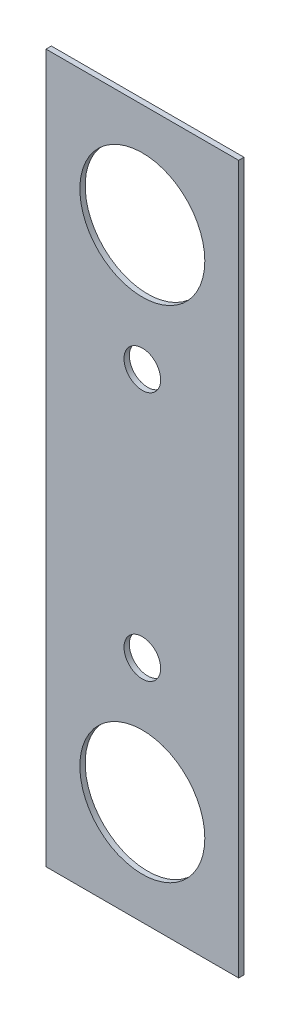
from build123d import *

# Parameters (mm, degrees)
SKETCH1_W           = 29.36875
SKETCH1_H           = 107.95
SKETCH1_R           = 9.525
SKETCH1_R_2         = 2.794
BOSS_EXTRUDE1_DEPTH = 0.8128


with BuildPart() as part:
    # Sketch1 → Boss-Extrude1 (new body)
    with BuildSketch(Plane.XY):
        Rectangle(SKETCH1_W, SKETCH1_H)
        with Locations((0, -38.1)):
            Circle(SKETCH1_R, mode=Mode.SUBTRACT)
        with Locations((0, 38.1)):
            Circle(SKETCH1_R, mode=Mode.SUBTRACT)
        with Locations((0, 19.05)):
            Circle(SKETCH1_R_2, mode=Mode.SUBTRACT)
        with Locations((0, -19.05)):
            Circle(SKETCH1_R_2, mode=Mode.SUBTRACT)
    extrude(amount=BOSS_EXTRUDE1_DEPTH)


solid = part.part
